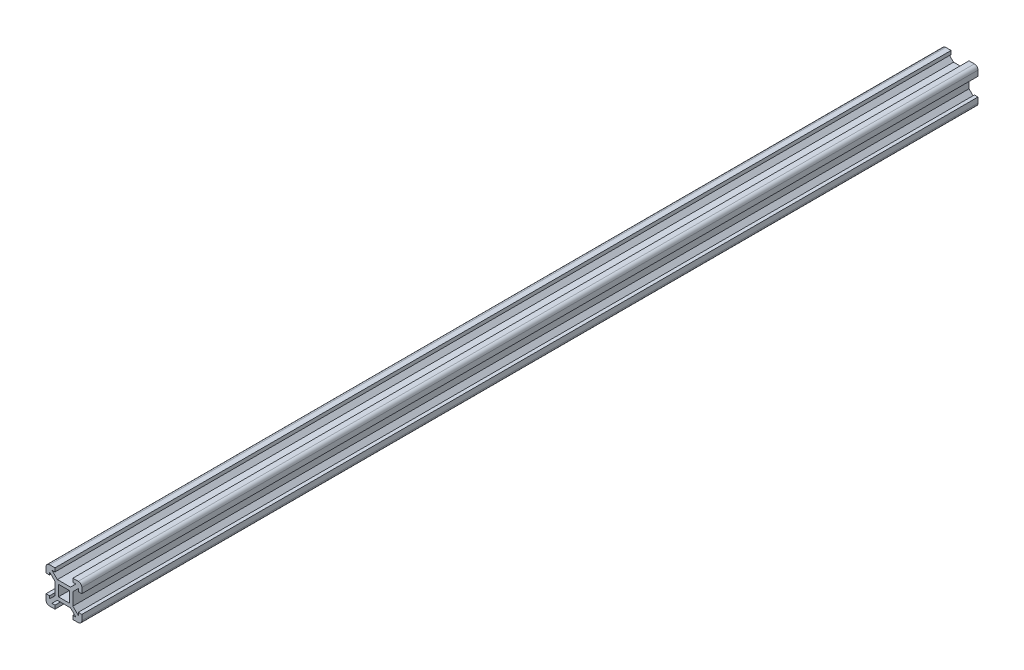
from build123d import *

# Parameters (mm, degrees)
ESQUISSE1_W      = 6.085415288
ESQUISSE1_H      = 6.085415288
EXTRUSION1_DEPTH = 500


with BuildPart() as part:
    # Esquisse1 → Extrusion1 (new body)
    with BuildSketch(Plane.XY):
        with BuildLine():
            Line((5, 13.522668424), (5, 6.477331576))
            Line((5, 6.477331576), (2, 3.521413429))
            Line((2, 3.521413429), (2, 5))
            Line((2, 5), (0, 5))
            Line((0, 5), (0, 2))
            ThreePointArc((0, 2), (0.585786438, 0.585786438), (2, 0))
            Line((2, 0), (5, 0))
            Line((5, 0), (5, 2))
            Line((5, 2), (3.305493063, 2))
            Line((3.305493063, 2), (6.350232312, 5))
            Line((6.350232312, 5), (13.649767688, 5))
            Line((13.649767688, 5), (16.694506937, 2))
            Line((16.694506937, 2), (15, 2))
            Line((15, 2), (15, 0))
            Line((15, 0), (18, 0))
            ThreePointArc((18, 0), (19.414213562, 0.585786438), (20, 2))
            Line((20, 2), (20, 5))
            Line((20, 5), (18, 5))
            Line((18, 5), (18, 3.521413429))
            Line((18, 3.521413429), (15, 6.477331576))
            Line((15, 6.477331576), (15, 13.522668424))
            Line((15, 13.522668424), (18, 16.478586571))
            Line((18, 16.478586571), (18, 15))
            Line((18, 15), (20, 15))
            Line((20, 15), (20, 18))
            ThreePointArc((20, 18), (19.414213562, 19.414213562), (18, 20))
            Line((18, 20), (15, 20))
            Line((15, 20), (15, 18))
            Line((15, 18), (16.694506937, 18))
            Line((16.694506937, 18), (13.649767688, 15))
            Line((13.649767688, 15), (6.350232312, 15))
            Line((6.350232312, 15), (3.305493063, 18))
            Line((3.305493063, 18), (5, 18))
            Line((5, 18), (5, 20))
            Line((5, 20), (2, 20))
            ThreePointArc((2, 20), (0.585786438, 19.414213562), (0, 18))
            Line((0, 18), (0, 15))
            Line((0, 15), (2, 15))
            Line((2, 15), (2, 16.478586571))
            Line((2, 16.478586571), (5, 13.522668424))
        make_face()
        with Locations((10, 10)):
            Rectangle(ESQUISSE1_W, ESQUISSE1_H, mode=Mode.SUBTRACT)
    extrude(amount=EXTRUSION1_DEPTH)


solid = part.part
